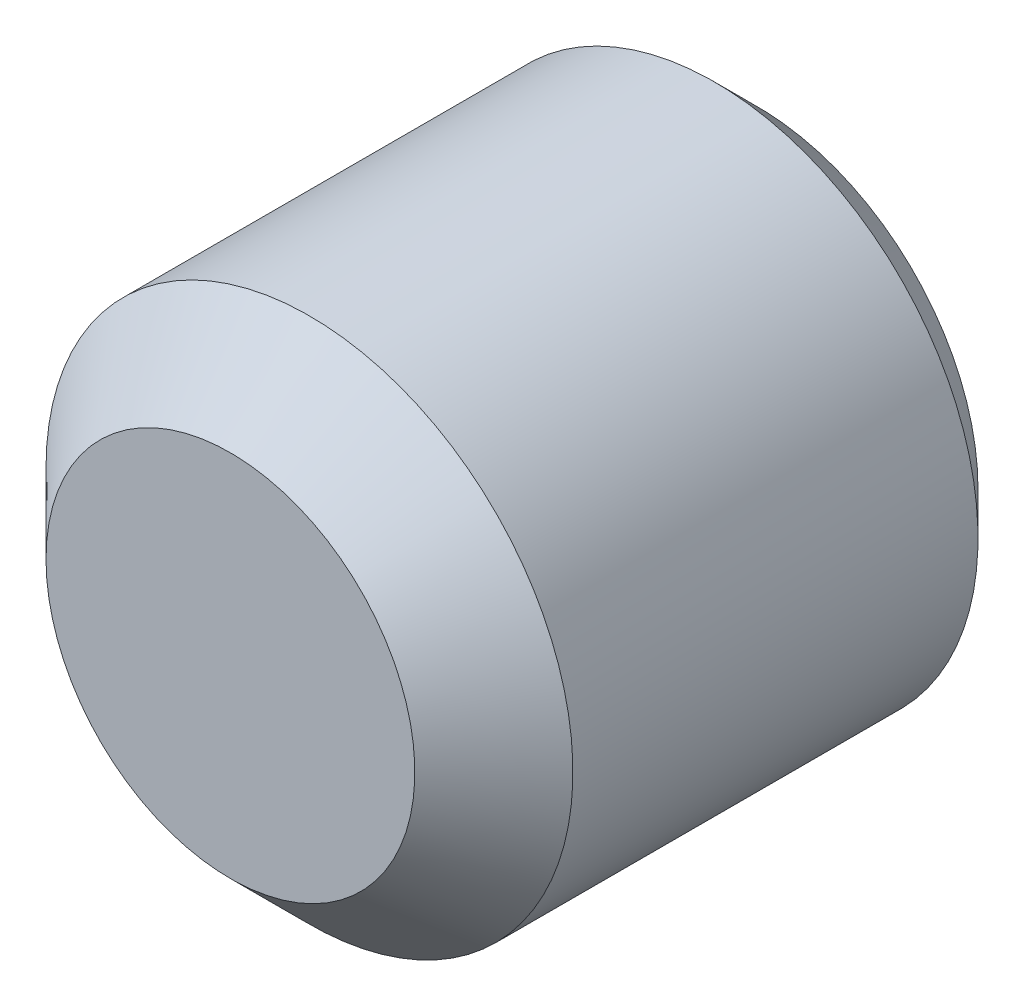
ISO-10303-21;
HEADER;
FILE_DESCRIPTION(('STEP AP214'),'2;1');
FILE_NAME('part.step','',(''),(''),'','','');
FILE_SCHEMA(('AUTOMOTIVE_DESIGN { 1 0 10303 214 1 1 1 1 }'));
ENDSEC;
DATA;
#1=APPLICATION_CONTEXT('core data for automotive mechanical design processes');
#2=APPLICATION_PROTOCOL_DEFINITION('international standard','automotive_design',2000,#1);
#3=PRODUCT_CONTEXT('',#1,'mechanical');
#4=PRODUCT('Part','Part','',(#3));
#5=PRODUCT_RELATED_PRODUCT_CATEGORY('part','',(#4));
#6=PRODUCT_DEFINITION_FORMATION('','',#4);
#7=PRODUCT_DEFINITION_CONTEXT('part definition',#1,'design');
#8=PRODUCT_DEFINITION('design','',#6,#7);
#9=PRODUCT_DEFINITION_SHAPE('','',#8);
#10=(LENGTH_UNIT() NAMED_UNIT(*) SI_UNIT(.MILLI.,.METRE.));
#11=(NAMED_UNIT(*) PLANE_ANGLE_UNIT() SI_UNIT($,.RADIAN.));
#12=(NAMED_UNIT(*) SI_UNIT($,.STERADIAN.) SOLID_ANGLE_UNIT());
#13=UNCERTAINTY_MEASURE_WITH_UNIT(LENGTH_MEASURE(1.E-05),#10,'distance_accuracy_value','');
#14=(GEOMETRIC_REPRESENTATION_CONTEXT(3) GLOBAL_UNCERTAINTY_ASSIGNED_CONTEXT((#13)) GLOBAL_UNIT_ASSIGNED_CONTEXT((#10,
#11,#12)) REPRESENTATION_CONTEXT('',''));
#15=CARTESIAN_POINT('',(0.,0.,0.));
#16=DIRECTION('',(0.,0.,1.));
#17=DIRECTION('',(1.,0.,0.));
#18=AXIS2_PLACEMENT_3D('',#15,#16,#17);
#19=CARTESIAN_POINT('',(0.,0.,0.));
#20=DIRECTION('',(0.,0.,-1.));
#21=DIRECTION('',(-1.,0.,0.));
#22=AXIS2_PLACEMENT_3D('',#19,#20,#21);
#23=PLANE('',#22);
#24=CARTESIAN_POINT('',(0.,0.,0.));
#25=DIRECTION('',(0.,0.,-1.));
#26=DIRECTION('',(-1.,0.,0.));
#27=AXIS2_PLACEMENT_3D('',#24,#25,#26);
#28=CIRCLE('',#27,4.188125);
#29=CARTESIAN_POINT('',(-4.188125,0.,0.));
#30=VERTEX_POINT('',#29);
#31=EDGE_CURVE('E11',#30,#30,#28,.T.);
#32=ORIENTED_EDGE('',*,*,#31,.T.);
#33=EDGE_LOOP('',(#32));
#34=FACE_BOUND('',#33,.T.);
#35=DIRECTION('',(-1.,0.,0.));
#36=VECTOR('',#35,1.);
#37=CARTESIAN_POINT('',(1.44337567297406,2.5,0.));
#38=LINE('',#37,#36);
#39=CARTESIAN_POINT('',(1.44337567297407,2.5,0.));
#40=VERTEX_POINT('',#39);
#41=CARTESIAN_POINT('',(-1.44337567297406,2.5,0.));
#42=VERTEX_POINT('',#41);
#43=EDGE_CURVE('E91',#40,#42,#38,.T.);
#44=ORIENTED_EDGE('',*,*,#43,.T.);
#45=DIRECTION('',(-0.5,-0.866025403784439,0.));
#46=VECTOR('',#45,1.);
#47=CARTESIAN_POINT('',(-1.44337567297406,2.5,0.));
#48=LINE('',#47,#46);
#49=CARTESIAN_POINT('',(-2.88675134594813,0.,0.));
#50=VERTEX_POINT('',#49);
#51=EDGE_CURVE('E30',#42,#50,#48,.T.);
#52=ORIENTED_EDGE('',*,*,#51,.T.);
#53=DIRECTION('',(0.5,-0.866025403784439,0.));
#54=VECTOR('',#53,1.);
#55=CARTESIAN_POINT('',(-2.88675134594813,0.,0.));
#56=LINE('',#55,#54);
#57=CARTESIAN_POINT('',(-1.44337567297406,-2.5,0.));
#58=VERTEX_POINT('',#57);
#59=EDGE_CURVE('E159',#50,#58,#56,.T.);
#60=ORIENTED_EDGE('',*,*,#59,.T.);
#61=DIRECTION('',(1.,0.,0.));
#62=VECTOR('',#61,1.);
#63=CARTESIAN_POINT('',(-1.44337567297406,-2.5,0.));
#64=LINE('',#63,#62);
#65=CARTESIAN_POINT('',(1.44337567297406,-2.5,0.));
#66=VERTEX_POINT('',#65);
#67=EDGE_CURVE('E155',#58,#66,#64,.T.);
#68=ORIENTED_EDGE('',*,*,#67,.T.);
#69=DIRECTION('',(0.5,0.866025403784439,0.));
#70=VECTOR('',#69,1.);
#71=CARTESIAN_POINT('',(1.44337567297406,-2.5,0.));
#72=LINE('',#71,#70);
#73=CARTESIAN_POINT('',(2.88675134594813,0.,0.));
#74=VERTEX_POINT('',#73);
#75=EDGE_CURVE('E150',#66,#74,#72,.T.);
#76=ORIENTED_EDGE('',*,*,#75,.T.);
#77=DIRECTION('',(-0.5,0.866025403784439,0.));
#78=VECTOR('',#77,1.);
#79=CARTESIAN_POINT('',(2.88675134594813,0.,0.));
#80=LINE('',#79,#78);
#81=EDGE_CURVE('E95',#74,#40,#80,.T.);
#82=ORIENTED_EDGE('',*,*,#81,.T.);
#83=EDGE_LOOP('',(#44,#52,#60,#68,#76,#82));
#84=FACE_BOUND('',#83,.T.);
#85=ADVANCED_FACE('F16',(#34,#84),#23,.T.);
#86=CARTESIAN_POINT('',(0.,0.,0.811875));
#87=DIRECTION('',(0.,0.,1.));
#88=DIRECTION('',(1.,0.,0.));
#89=AXIS2_PLACEMENT_3D('',#86,#87,#88);
#90=CONICAL_SURFACE('',#89,5.,0.785398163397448);
#91=ORIENTED_EDGE('',*,*,#31,.F.);
#92=EDGE_LOOP('',(#91));
#93=FACE_BOUND('',#92,.T.);
#94=CARTESIAN_POINT('',(0.,0.,0.811875));
#95=DIRECTION('',(0.,0.,-1.));
#96=DIRECTION('',(-1.,0.,0.));
#97=AXIS2_PLACEMENT_3D('',#94,#95,#96);
#98=CIRCLE('',#97,5.);
#99=CARTESIAN_POINT('',(-5.,0.,0.811874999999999));
#100=VERTEX_POINT('',#99);
#101=EDGE_CURVE('E23',#100,#100,#98,.T.);
#102=ORIENTED_EDGE('',*,*,#101,.T.);
#103=EDGE_LOOP('',(#102));
#104=FACE_BOUND('',#103,.T.);
#105=ADVANCED_FACE('F114',(#93,#104),#90,.T.);
#106=CARTESIAN_POINT('',(0.,0.,0.));
#107=DIRECTION('',(0.,0.,-1.));
#108=DIRECTION('',(-1.,0.,0.));
#109=AXIS2_PLACEMENT_3D('',#106,#107,#108);
#110=CYLINDRICAL_SURFACE('',#109,5.);
#111=ORIENTED_EDGE('',*,*,#101,.F.);
#112=EDGE_LOOP('',(#111));
#113=FACE_BOUND('',#112,.T.);
#114=CARTESIAN_POINT('',(0.,0.,8.5));
#115=DIRECTION('',(0.,0.,-1.));
#116=DIRECTION('',(-1.,0.,0.));
#117=AXIS2_PLACEMENT_3D('',#114,#115,#116);
#118=CIRCLE('',#117,5.);
#119=CARTESIAN_POINT('',(-5.,0.,8.5));
#120=VERTEX_POINT('',#119);
#121=EDGE_CURVE('E109',#120,#120,#118,.T.);
#122=ORIENTED_EDGE('',*,*,#121,.T.);
#123=EDGE_LOOP('',(#122));
#124=FACE_BOUND('',#123,.T.);
#125=ADVANCED_FACE('F116',(#113,#124),#110,.T.);
#126=CARTESIAN_POINT('',(0.,0.,10.));
#127=DIRECTION('',(0.,0.,-1.));
#128=DIRECTION('',(-1.,0.,0.));
#129=AXIS2_PLACEMENT_3D('',#126,#127,#128);
#130=CONICAL_SURFACE('',#129,3.5,0.785398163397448);
#131=ORIENTED_EDGE('',*,*,#121,.F.);
#132=EDGE_LOOP('',(#131));
#133=FACE_BOUND('',#132,.T.);
#134=CARTESIAN_POINT('',(0.,0.,10.));
#135=DIRECTION('',(0.,0.,-1.));
#136=DIRECTION('',(-1.,0.,0.));
#137=AXIS2_PLACEMENT_3D('',#134,#135,#136);
#138=CIRCLE('',#137,3.5);
#139=CARTESIAN_POINT('',(-3.5,0.,10.));
#140=VERTEX_POINT('',#139);
#141=EDGE_CURVE('E106',#140,#140,#138,.T.);
#142=ORIENTED_EDGE('',*,*,#141,.T.);
#143=EDGE_LOOP('',(#142));
#144=FACE_BOUND('',#143,.T.);
#145=ADVANCED_FACE('F119',(#133,#144),#130,.T.);
#146=CARTESIAN_POINT('',(0.,0.,10.));
#147=DIRECTION('',(0.,0.,-1.));
#148=DIRECTION('',(-1.,0.,0.));
#149=AXIS2_PLACEMENT_3D('',#146,#147,#148);
#150=PLANE('',#149);
#151=ORIENTED_EDGE('',*,*,#141,.F.);
#152=EDGE_LOOP('',(#151));
#153=FACE_BOUND('',#152,.T.);
#154=ADVANCED_FACE('F125',(#153),#150,.F.);
#155=CARTESIAN_POINT('',(-1.44337567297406,2.5,5.66666666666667));
#156=DIRECTION('',(0.866025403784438,-0.5,0.));
#157=DIRECTION('',(0.5,0.866025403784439,0.));
#158=AXIS2_PLACEMENT_3D('',#155,#156,#157);
#159=PLANE('',#158);
#160=DIRECTION('',(0.,0.,-1.));
#161=VECTOR('',#160,1.);
#162=CARTESIAN_POINT('',(-2.88675134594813,0.,5.66666666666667));
#163=LINE('',#162,#161);
#164=CARTESIAN_POINT('',(-2.88675134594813,0.,4.));
#165=VERTEX_POINT('',#164);
#166=EDGE_CURVE('E104',#165,#50,#163,.T.);
#167=ORIENTED_EDGE('',*,*,#166,.T.);
#168=ORIENTED_EDGE('',*,*,#51,.F.);
#169=DIRECTION('',(0.,0.,-1.));
#170=VECTOR('',#169,1.);
#171=CARTESIAN_POINT('',(-1.44337567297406,2.5,5.66666666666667));
#172=LINE('',#171,#170);
#173=CARTESIAN_POINT('',(-1.44337567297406,2.5,4.));
#174=VERTEX_POINT('',#173);
#175=EDGE_CURVE('E85',#174,#42,#172,.T.);
#176=ORIENTED_EDGE('',*,*,#175,.F.);
#177=CARTESIAN_POINT('',(-2.88675146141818,-2.E-07,3.99999993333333));
#178=CARTESIAN_POINT('',(-2.82332384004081,0.10985966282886,4.03663050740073));
#179=CARTESIAN_POINT('',(-2.75934871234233,0.220667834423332,4.06994409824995));
#180=CARTESIAN_POINT('',(-2.63029077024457,0.444202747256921,4.12809197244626));
#181=CARTESIAN_POINT('',(-2.56520566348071,0.556933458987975,4.15290568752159));
#182=CARTESIAN_POINT('',(-2.43584201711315,0.78099786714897,4.19153002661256));
#183=CARTESIAN_POINT('',(-2.37158337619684,0.892297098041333,4.20559774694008));
#184=CARTESIAN_POINT('',(-2.242763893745,1.11541898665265,4.22238853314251));
#185=CARTESIAN_POINT('',(-2.17820352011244,1.22724083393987,4.22512550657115));
#186=CARTESIAN_POINT('',(-2.05757937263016,1.43616798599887,4.21941714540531));
#187=CARTESIAN_POINT('',(-2.00149749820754,1.53330464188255,4.21237340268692));
#188=CARTESIAN_POINT('',(-1.8896991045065,1.72694513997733,4.19005338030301));
#189=CARTESIAN_POINT('',(-1.8339829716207,1.8234483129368,4.17476948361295));
#190=CARTESIAN_POINT('',(-1.721954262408,2.01748772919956,4.136562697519));
#191=CARTESIAN_POINT('',(-1.66565585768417,2.1149994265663,4.11347792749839));
#192=CARTESIAN_POINT('',(-1.5538984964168,2.30856885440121,4.06108525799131));
#193=CARTESIAN_POINT('',(-1.49843810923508,2.40462906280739,4.03178966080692));
#194=CARTESIAN_POINT('',(-1.44337555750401,2.5000002,3.99999993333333));
#195=B_SPLINE_CURVE_WITH_KNOTS('',3,(#177,#178,#179,#180,#181,#182,#183,#184,#185,#186,#187,
#188,#189,#190,#191,#192,#193,#194),.UNSPECIFIED.,.F.,.F.,(4,2,2,2,2,2,2,2,4),(0.,
0.396270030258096,0.793492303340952,1.18088455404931,1.56780117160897,1.90463489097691,
2.24178050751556,2.58640240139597,2.9303479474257),.UNSPECIFIED.);
#196=EDGE_CURVE('E78',#165,#174,#195,.T.);
#197=ORIENTED_EDGE('',*,*,#196,.F.);
#198=EDGE_LOOP('',(#167,#168,#176,#197));
#199=FACE_BOUND('',#198,.T.);
#200=ADVANCED_FACE('F86',(#199),#159,.T.);
#201=CARTESIAN_POINT('',(-2.88675134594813,0.,5.66666666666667));
#202=DIRECTION('',(0.866025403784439,0.5,0.));
#203=DIRECTION('',(-0.5,0.866025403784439,0.));
#204=AXIS2_PLACEMENT_3D('',#201,#202,#203);
#205=PLANE('',#204);
#206=DIRECTION('',(0.,0.,-1.));
#207=VECTOR('',#206,1.);
#208=CARTESIAN_POINT('',(-1.44337567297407,-2.5,5.66666666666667));
#209=LINE('',#208,#207);
#210=CARTESIAN_POINT('',(-1.44337567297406,-2.5,4.));
#211=VERTEX_POINT('',#210);
#212=EDGE_CURVE('E102',#211,#58,#209,.T.);
#213=ORIENTED_EDGE('',*,*,#212,.T.);
#214=ORIENTED_EDGE('',*,*,#59,.F.);
#215=ORIENTED_EDGE('',*,*,#166,.F.);
#216=CARTESIAN_POINT('',(-1.44337555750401,-2.5000002,3.99999993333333));
#217=CARTESIAN_POINT('',(-1.50680317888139,-2.39014033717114,4.03663050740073));
#218=CARTESIAN_POINT('',(-1.57077830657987,-2.27933216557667,4.06994409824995));
#219=CARTESIAN_POINT('',(-1.69983624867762,-2.05579725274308,4.12809197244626));
#220=CARTESIAN_POINT('',(-1.76492135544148,-1.94306654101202,4.15290568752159));
#221=CARTESIAN_POINT('',(-1.89428500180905,-1.71900213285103,4.19153002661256));
#222=CARTESIAN_POINT('',(-1.95854364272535,-1.60770290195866,4.20559774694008));
#223=CARTESIAN_POINT('',(-2.0873631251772,-1.38458101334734,4.22238853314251));
#224=CARTESIAN_POINT('',(-2.15192349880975,-1.27275916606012,4.22512550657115));
#225=CARTESIAN_POINT('',(-2.27254764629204,-1.06383201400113,4.21941714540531));
#226=CARTESIAN_POINT('',(-2.32862952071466,-0.966695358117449,4.21237340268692));
#227=CARTESIAN_POINT('',(-2.44042791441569,-0.773054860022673,4.190053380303));
#228=CARTESIAN_POINT('',(-2.4961440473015,-0.676551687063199,4.17476948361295));
#229=CARTESIAN_POINT('',(-2.6081727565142,-0.482512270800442,4.136562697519));
#230=CARTESIAN_POINT('',(-2.66447116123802,-0.385000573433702,4.11347792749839));
#231=CARTESIAN_POINT('',(-2.77622852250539,-0.191431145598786,4.06108525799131));
#232=CARTESIAN_POINT('',(-2.83168890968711,-0.0953709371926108,4.03178966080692));
#233=CARTESIAN_POINT('',(-2.88675146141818,1.99999999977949E-07,3.99999993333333));
#234=B_SPLINE_CURVE_WITH_KNOTS('',3,(#216,#217,#218,#219,#220,#221,#222,#223,#224,#225,#226,
#227,#228,#229,#230,#231,#232,#233),.UNSPECIFIED.,.F.,.F.,(4,2,2,2,2,2,2,2,4),(0.,
0.396270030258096,0.793492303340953,1.18088455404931,1.56780117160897,1.90463489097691,
2.24178050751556,2.58640240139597,2.9303479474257),.UNSPECIFIED.);
#235=EDGE_CURVE('E82',#211,#165,#234,.T.);
#236=ORIENTED_EDGE('',*,*,#235,.F.);
#237=EDGE_LOOP('',(#213,#214,#215,#236));
#238=FACE_BOUND('',#237,.T.);
#239=ADVANCED_FACE('F135',(#238),#205,.T.);
#240=CARTESIAN_POINT('',(-1.44337567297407,-2.5,5.66666666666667));
#241=DIRECTION('',(0.,1.,0.));
#242=DIRECTION('',(-1.,0.,0.));
#243=AXIS2_PLACEMENT_3D('',#240,#241,#242);
#244=PLANE('',#243);
#245=DIRECTION('',(0.,0.,-1.));
#246=VECTOR('',#245,1.);
#247=CARTESIAN_POINT('',(1.44337567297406,-2.5,5.66666666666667));
#248=LINE('',#247,#246);
#249=CARTESIAN_POINT('',(1.44337567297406,-2.5,4.));
#250=VERTEX_POINT('',#249);
#251=EDGE_CURVE('E100',#250,#66,#248,.T.);
#252=ORIENTED_EDGE('',*,*,#251,.T.);
#253=ORIENTED_EDGE('',*,*,#67,.F.);
#254=ORIENTED_EDGE('',*,*,#212,.F.);
#255=CARTESIAN_POINT('',(3.73786280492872,-2.5,3.07041177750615));
#256=CARTESIAN_POINT('',(3.62990419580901,-2.5,3.12220623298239));
#257=CARTESIAN_POINT('',(3.52168258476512,-2.5,3.17346270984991));
#258=CARTESIAN_POINT('',(3.30457318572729,-2.5,3.27459452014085));
#259=CARTESIAN_POINT('',(3.19568528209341,-2.5,3.32446960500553));
#260=CARTESIAN_POINT('',(2.97647879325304,-2.5,3.42281207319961));
#261=CARTESIAN_POINT('',(2.8661555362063,-2.5,3.47126908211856));
#262=CARTESIAN_POINT('',(2.64458326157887,-2.5,3.56601016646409));
#263=CARTESIAN_POINT('',(2.53333429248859,-2.5,3.61229435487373));
#264=CARTESIAN_POINT('',(2.30680313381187,-2.5,3.70328978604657));
#265=CARTESIAN_POINT('',(2.19149154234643,-2.5,3.74792826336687));
#266=CARTESIAN_POINT('',(1.95947357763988,-2.5,3.8334939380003));
#267=CARTESIAN_POINT('',(1.84276704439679,-2.5,3.87442070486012));
#268=CARTESIAN_POINT('',(1.60804308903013,-2.5,3.9513925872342));
#269=CARTESIAN_POINT('',(1.49002940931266,-2.5,3.98744899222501));
#270=CARTESIAN_POINT('',(1.25231072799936,-2.5,4.05344707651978));
#271=CARTESIAN_POINT('',(1.13260615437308,-2.5,4.08339027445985));
#272=CARTESIAN_POINT('',(0.891755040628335,-2.5,4.13556574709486));
#273=CARTESIAN_POINT('',(0.77061199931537,-2.5,4.15781385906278));
#274=CARTESIAN_POINT('',(0.526970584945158,-2.5,4.19314231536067));
#275=CARTESIAN_POINT('',(0.404472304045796,-2.5,4.20622327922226));
#276=CARTESIAN_POINT('',(0.160266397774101,-2.5,4.22200378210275));
#277=CARTESIAN_POINT('',(0.0385668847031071,-2.5,4.22482582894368));
#278=CARTESIAN_POINT('',(-0.204641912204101,-2.5,4.2201642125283));
#279=CARTESIAN_POINT('',(-0.326151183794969,-2.5,4.2126799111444));
#280=CARTESIAN_POINT('',(-0.536550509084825,-2.5,4.19130137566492));
#281=CARTESIAN_POINT('',(-0.625673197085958,-2.5,4.17959119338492));
#282=CARTESIAN_POINT('',(-0.803173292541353,-2.5,4.15143179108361));
#283=CARTESIAN_POINT('',(-0.891550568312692,-2.5,4.13498175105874));
#284=CARTESIAN_POINT('',(-1.15551872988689,-2.5,4.07939186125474));
#285=CARTESIAN_POINT('',(-1.32980846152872,-2.5,4.03402793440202));
#286=CARTESIAN_POINT('',(-1.59042393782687,-2.5,3.95652588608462));
#287=CARTESIAN_POINT('',(-1.67812348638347,-2.5,3.92875431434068));
#288=CARTESIAN_POINT('',(-1.8526147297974,-2.5,3.87064295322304));
#289=CARTESIAN_POINT('',(-1.93940695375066,-2.5,3.84030476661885));
#290=CARTESIAN_POINT('',(-2.11219306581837,-2.5,3.7774997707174));
#291=CARTESIAN_POINT('',(-2.19818709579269,-2.5,3.74503334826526));
#292=CARTESIAN_POINT('',(-2.36949800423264,-2.5,3.67832354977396));
#293=CARTESIAN_POINT('',(-2.4548147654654,-2.5,3.6440798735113));
#294=CARTESIAN_POINT('',(-2.67258788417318,-2.5,3.55447732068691));
#295=CARTESIAN_POINT('',(-2.80460848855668,-2.5,3.49806074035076));
#296=CARTESIAN_POINT('',(-3.06746028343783,-2.5,3.38251346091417));
#297=CARTESIAN_POINT('',(-3.19829138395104,-2.5,3.32338255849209));
#298=CARTESIAN_POINT('',(-3.45901011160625,-2.5,3.20302302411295));
#299=CARTESIAN_POINT('',(-3.58889757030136,-2.5,3.14179402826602));
#300=CARTESIAN_POINT('',(-3.84789024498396,-2.5,3.01770085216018));
#301=CARTESIAN_POINT('',(-3.97699544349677,-2.5,2.95483663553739));
#302=CARTESIAN_POINT('',(-4.36366993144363,-2.5,2.7641677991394));
#303=CARTESIAN_POINT('',(-4.62028653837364,-2.5,2.63443298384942));
#304=CARTESIAN_POINT('',(-5.13176271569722,-2.5,2.37164542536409));
#305=CARTESIAN_POINT('',(-5.38662250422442,-2.5,2.23859310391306));
#306=CARTESIAN_POINT('',(-5.87112719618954,-2.5,1.98285278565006));
#307=CARTESIAN_POINT('',(-6.10088157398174,-2.5,1.86037185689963));
#308=CARTESIAN_POINT('',(-6.55965134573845,-2.5,1.61401553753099));
#309=CARTESIAN_POINT('',(-6.78866671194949,-2.5,1.49014009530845));
#310=CARTESIAN_POINT('',(-7.24554624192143,-2.5,1.24165978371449));
#311=CARTESIAN_POINT('',(-7.47341185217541,-2.5,1.11705757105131));
#312=CARTESIAN_POINT('',(-7.92868238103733,-2.5,0.867042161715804));
#313=CARTESIAN_POINT('',(-8.15608732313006,-2.5,0.741629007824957));
#314=CARTESIAN_POINT('',(-8.38332676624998,-2.5,0.615918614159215));
#315=B_SPLINE_CURVE_WITH_KNOTS('',3,(#255,#256,#257,#258,#259,#260,#261,#262,#263,#264,#265,
#266,#267,#268,#269,#270,#271,#272,#273,#274,#275,#276,#277,#278,#279,#280,#281,#282,#283,#284,
#285,#286,#287,#288,#289,#290,#291,#292,#293,#294,#295,#296,#297,#298,#299,#300,#301,#302,#303,
#304,#305,#306,#307,#308,#309,#310,#311,#312,#313,#314),.UNSPECIFIED.,.F.,.F.,(4,2,2,2,2,2,2,2,
2,2,2,2,2,2,2,2,2,2,2,2,2,2,2,2,2,2,2,2,2,4),(0.,0.359225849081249,0.718515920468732,
1.07998545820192,1.44143617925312,1.81233727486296,2.1832813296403,2.55335021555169,
2.92332705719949,3.29253785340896,3.66172369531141,4.02648611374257,4.39127111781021,
4.66080405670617,4.9303836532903,5.46995615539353,5.74591175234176,6.02169627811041,
6.29743081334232,6.57321207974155,7.00387724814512,7.43457472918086,7.86534729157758,
8.29612944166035,9.1587257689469,10.021212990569,10.8022940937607,11.5834041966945,
12.3625275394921,13.1416101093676),.UNSPECIFIED.);
#316=EDGE_CURVE('E200',#250,#211,#315,.T.);
#317=ORIENTED_EDGE('',*,*,#316,.F.);
#318=EDGE_LOOP('',(#252,#253,#254,#317));
#319=FACE_BOUND('',#318,.T.);
#320=ADVANCED_FACE('F206',(#319),#244,.T.);
#321=CARTESIAN_POINT('',(1.44337567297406,-2.5,5.66666666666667));
#322=DIRECTION('',(-0.866025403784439,0.5,0.));
#323=DIRECTION('',(-0.5,-0.866025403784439,0.));
#324=AXIS2_PLACEMENT_3D('',#321,#322,#323);
#325=PLANE('',#324);
#326=DIRECTION('',(0.,0.,-1.));
#327=VECTOR('',#326,1.);
#328=CARTESIAN_POINT('',(2.88675134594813,0.,5.66666666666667));
#329=LINE('',#328,#327);
#330=CARTESIAN_POINT('',(2.88675134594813,0.,4.));
#331=VERTEX_POINT('',#330);
#332=EDGE_CURVE('E93',#331,#74,#329,.T.);
#333=ORIENTED_EDGE('',*,*,#332,.T.);
#334=ORIENTED_EDGE('',*,*,#75,.F.);
#335=ORIENTED_EDGE('',*,*,#251,.F.);
#336=CARTESIAN_POINT('',(2.88675146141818,1.99999999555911E-07,3.99999993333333));
#337=CARTESIAN_POINT('',(2.8233238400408,-0.109859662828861,4.03663050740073));
#338=CARTESIAN_POINT('',(2.75934871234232,-0.220667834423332,4.06994409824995));
#339=CARTESIAN_POINT('',(2.63029077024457,-0.444202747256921,4.12809197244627));
#340=CARTESIAN_POINT('',(2.56520566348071,-0.556933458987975,4.15290568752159));
#341=CARTESIAN_POINT('',(2.43584201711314,-0.78099786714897,4.19153002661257));
#342=CARTESIAN_POINT('',(2.37158337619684,-0.892297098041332,4.20559774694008));
#343=CARTESIAN_POINT('',(2.242763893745,-1.11541898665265,4.22238853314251));
#344=CARTESIAN_POINT('',(2.17820352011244,-1.22724083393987,4.22512550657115));
#345=CARTESIAN_POINT('',(2.05757937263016,-1.43616798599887,4.21941714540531));
#346=CARTESIAN_POINT('',(2.00149749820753,-1.53330464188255,4.21237340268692));
#347=CARTESIAN_POINT('',(1.8896991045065,-1.72694513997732,4.19005338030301));
#348=CARTESIAN_POINT('',(1.8339829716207,-1.8234483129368,4.17476948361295));
#349=CARTESIAN_POINT('',(1.721954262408,-2.01748772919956,4.136562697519));
#350=CARTESIAN_POINT('',(1.66565585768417,-2.1149994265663,4.1134779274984));
#351=CARTESIAN_POINT('',(1.5538984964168,-2.30856885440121,4.06108525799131));
#352=CARTESIAN_POINT('',(1.49843810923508,-2.40462906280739,4.03178966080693));
#353=CARTESIAN_POINT('',(1.44337555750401,-2.5000002,3.99999993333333));
#354=B_SPLINE_CURVE_WITH_KNOTS('',3,(#336,#337,#338,#339,#340,#341,#342,#343,#344,#345,#346,
#347,#348,#349,#350,#351,#352,#353),.UNSPECIFIED.,.F.,.F.,(4,2,2,2,2,2,2,2,4),(0.,
0.396270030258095,0.793492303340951,1.18088455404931,1.56780117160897,1.90463489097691,
2.24178050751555,2.58640240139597,2.9303479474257),.UNSPECIFIED.);
#355=EDGE_CURVE('E194',#331,#250,#354,.T.);
#356=ORIENTED_EDGE('',*,*,#355,.F.);
#357=EDGE_LOOP('',(#333,#334,#335,#356));
#358=FACE_BOUND('',#357,.T.);
#359=ADVANCED_FACE('F209',(#358),#325,.T.);
#360=CARTESIAN_POINT('',(2.88675134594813,0.,5.66666666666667));
#361=DIRECTION('',(-0.866025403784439,-0.5,0.));
#362=DIRECTION('',(0.5,-0.866025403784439,0.));
#363=AXIS2_PLACEMENT_3D('',#360,#361,#362);
#364=PLANE('',#363);
#365=DIRECTION('',(0.,0.,-1.));
#366=VECTOR('',#365,1.);
#367=CARTESIAN_POINT('',(1.44337567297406,2.5,5.66666666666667));
#368=LINE('',#367,#366);
#369=CARTESIAN_POINT('',(1.44337567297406,2.5,4.));
#370=VERTEX_POINT('',#369);
#371=EDGE_CURVE('E90',#370,#40,#368,.T.);
#372=ORIENTED_EDGE('',*,*,#371,.T.);
#373=ORIENTED_EDGE('',*,*,#81,.F.);
#374=ORIENTED_EDGE('',*,*,#332,.F.);
#375=CARTESIAN_POINT('',(1.44337555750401,2.5000002,3.99999993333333));
#376=CARTESIAN_POINT('',(1.50680317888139,2.39014033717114,4.03663050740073));
#377=CARTESIAN_POINT('',(1.57077830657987,2.27933216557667,4.06994409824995));
#378=CARTESIAN_POINT('',(1.69983624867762,2.05579725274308,4.12809197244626));
#379=CARTESIAN_POINT('',(1.76492135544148,1.94306654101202,4.15290568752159));
#380=CARTESIAN_POINT('',(1.89428500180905,1.71900213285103,4.19153002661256));
#381=CARTESIAN_POINT('',(1.95854364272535,1.60770290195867,4.20559774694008));
#382=CARTESIAN_POINT('',(2.0873631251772,1.38458101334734,4.22238853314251));
#383=CARTESIAN_POINT('',(2.15192349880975,1.27275916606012,4.22512550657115));
#384=CARTESIAN_POINT('',(2.27254764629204,1.06383201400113,4.21941714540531));
#385=CARTESIAN_POINT('',(2.32862952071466,0.966695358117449,4.21237340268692));
#386=CARTESIAN_POINT('',(2.44042791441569,0.773054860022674,4.190053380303));
#387=CARTESIAN_POINT('',(2.4961440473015,0.6765516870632,4.17476948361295));
#388=CARTESIAN_POINT('',(2.6081727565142,0.482512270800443,4.136562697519));
#389=CARTESIAN_POINT('',(2.66447116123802,0.385000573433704,4.11347792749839));
#390=CARTESIAN_POINT('',(2.77622852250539,0.191431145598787,4.06108525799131));
#391=CARTESIAN_POINT('',(2.83168890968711,0.095370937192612,4.03178966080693));
#392=CARTESIAN_POINT('',(2.88675146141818,-2.00000000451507E-07,3.99999993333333));
#393=B_SPLINE_CURVE_WITH_KNOTS('',3,(#375,#376,#377,#378,#379,#380,#381,#382,#383,#384,#385,
#386,#387,#388,#389,#390,#391,#392),.UNSPECIFIED.,.F.,.F.,(4,2,2,2,2,2,2,2,4),(0.,
0.396270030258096,0.793492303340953,1.18088455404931,1.56780117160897,1.90463489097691,
2.24178050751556,2.58640240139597,2.93034794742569),.UNSPECIFIED.);
#394=EDGE_CURVE('E38',#370,#331,#393,.T.);
#395=ORIENTED_EDGE('',*,*,#394,.F.);
#396=EDGE_LOOP('',(#372,#373,#374,#395));
#397=FACE_BOUND('',#396,.T.);
#398=ADVANCED_FACE('F149',(#397),#364,.T.);
#399=CARTESIAN_POINT('',(1.44337567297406,2.5,5.66666666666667));
#400=DIRECTION('',(0.,-1.,0.));
#401=DIRECTION('',(1.,0.,0.));
#402=AXIS2_PLACEMENT_3D('',#399,#400,#401);
#403=PLANE('',#402);
#404=ORIENTED_EDGE('',*,*,#175,.T.);
#405=ORIENTED_EDGE('',*,*,#43,.F.);
#406=ORIENTED_EDGE('',*,*,#371,.F.);
#407=CARTESIAN_POINT('',(3.73786280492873,2.5,3.07041177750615));
#408=CARTESIAN_POINT('',(3.62990419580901,2.5,3.12220623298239));
#409=CARTESIAN_POINT('',(3.52168258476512,2.5,3.17346270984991));
#410=CARTESIAN_POINT('',(3.30457318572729,2.5,3.27459452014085));
#411=CARTESIAN_POINT('',(3.19568528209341,2.5,3.32446960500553));
#412=CARTESIAN_POINT('',(2.97647879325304,2.5,3.42281207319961));
#413=CARTESIAN_POINT('',(2.86615553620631,2.5,3.47126908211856));
#414=CARTESIAN_POINT('',(2.64458326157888,2.5,3.56601016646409));
#415=CARTESIAN_POINT('',(2.5333342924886,2.5,3.61229435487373));
#416=CARTESIAN_POINT('',(2.30680313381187,2.5,3.70328978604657));
#417=CARTESIAN_POINT('',(2.19149154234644,2.5,3.74792826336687));
#418=CARTESIAN_POINT('',(1.95947357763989,2.5,3.8334939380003));
#419=CARTESIAN_POINT('',(1.84276704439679,2.5,3.87442070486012));
#420=CARTESIAN_POINT('',(1.60804308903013,2.5,3.9513925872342));
#421=CARTESIAN_POINT('',(1.49002940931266,2.5,3.98744899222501));
#422=CARTESIAN_POINT('',(1.25231072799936,2.5,4.05344707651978));
#423=CARTESIAN_POINT('',(1.13260615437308,2.5,4.08339027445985));
#424=CARTESIAN_POINT('',(0.891755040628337,2.5,4.13556574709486));
#425=CARTESIAN_POINT('',(0.770611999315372,2.5,4.15781385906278));
#426=CARTESIAN_POINT('',(0.526970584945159,2.5,4.19314231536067));
#427=CARTESIAN_POINT('',(0.404472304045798,2.5,4.20622327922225));
#428=CARTESIAN_POINT('',(0.160266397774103,2.5,4.22200378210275));
#429=CARTESIAN_POINT('',(0.0385668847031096,2.5,4.22482582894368));
#430=CARTESIAN_POINT('',(-0.204641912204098,2.5,4.2201642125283));
#431=CARTESIAN_POINT('',(-0.326151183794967,2.5,4.2126799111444));
#432=CARTESIAN_POINT('',(-0.536550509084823,2.5,4.19130137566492));
#433=CARTESIAN_POINT('',(-0.625673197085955,2.5,4.17959119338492));
#434=CARTESIAN_POINT('',(-0.80317329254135,2.5,4.15143179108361));
#435=CARTESIAN_POINT('',(-0.891550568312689,2.5,4.13498175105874));
#436=CARTESIAN_POINT('',(-1.15551872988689,2.5,4.07939186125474));
#437=CARTESIAN_POINT('',(-1.32980846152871,2.5,4.03402793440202));
#438=CARTESIAN_POINT('',(-1.59042393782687,2.5,3.95652588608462));
#439=CARTESIAN_POINT('',(-1.67812348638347,2.5,3.92875431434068));
#440=CARTESIAN_POINT('',(-1.85261472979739,2.5,3.87064295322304));
#441=CARTESIAN_POINT('',(-1.93940695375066,2.5,3.84030476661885));
#442=CARTESIAN_POINT('',(-2.11219306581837,2.5,3.7774997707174));
#443=CARTESIAN_POINT('',(-2.19818709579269,2.5,3.74503334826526));
#444=CARTESIAN_POINT('',(-2.36949800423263,2.5,3.67832354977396));
#445=CARTESIAN_POINT('',(-2.4548147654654,2.5,3.6440798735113));
#446=CARTESIAN_POINT('',(-2.67258788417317,2.5,3.55447732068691));
#447=CARTESIAN_POINT('',(-2.80460848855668,2.5,3.49806074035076));
#448=CARTESIAN_POINT('',(-3.06746028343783,2.5,3.38251346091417));
#449=CARTESIAN_POINT('',(-3.19829138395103,2.5,3.32338255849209));
#450=CARTESIAN_POINT('',(-3.45901011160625,2.5,3.20302302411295));
#451=CARTESIAN_POINT('',(-3.58889757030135,2.5,3.14179402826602));
#452=CARTESIAN_POINT('',(-3.84789024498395,2.5,3.01770085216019));
#453=CARTESIAN_POINT('',(-3.97699544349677,2.5,2.95483663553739));
#454=CARTESIAN_POINT('',(-4.36366993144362,2.5,2.7641677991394));
#455=CARTESIAN_POINT('',(-4.62028653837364,2.5,2.63443298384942));
#456=CARTESIAN_POINT('',(-5.13176271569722,2.5,2.37164542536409));
#457=CARTESIAN_POINT('',(-5.38662250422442,2.5,2.23859310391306));
#458=CARTESIAN_POINT('',(-5.87112719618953,2.5,1.98285278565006));
#459=CARTESIAN_POINT('',(-6.10088157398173,2.5,1.86037185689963));
#460=CARTESIAN_POINT('',(-6.55965134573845,2.5,1.61401553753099));
#461=CARTESIAN_POINT('',(-6.78866671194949,2.5,1.49014009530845));
#462=CARTESIAN_POINT('',(-7.24554624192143,2.50000000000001,1.24165978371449));
#463=CARTESIAN_POINT('',(-7.47341185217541,2.50000000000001,1.11705757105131));
#464=CARTESIAN_POINT('',(-7.92868238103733,2.50000000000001,0.867042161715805));
#465=CARTESIAN_POINT('',(-8.15608732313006,2.5,0.741629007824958));
#466=CARTESIAN_POINT('',(-8.38332676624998,2.5,0.615918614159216));
#467=B_SPLINE_CURVE_WITH_KNOTS('',3,(#407,#408,#409,#410,#411,#412,#413,#414,#415,#416,#417,
#418,#419,#420,#421,#422,#423,#424,#425,#426,#427,#428,#429,#430,#431,#432,#433,#434,#435,#436,
#437,#438,#439,#440,#441,#442,#443,#444,#445,#446,#447,#448,#449,#450,#451,#452,#453,#454,#455,
#456,#457,#458,#459,#460,#461,#462,#463,#464,#465,#466),.UNSPECIFIED.,.F.,.F.,(4,2,2,2,2,2,2,2,
2,2,2,2,2,2,2,2,2,2,2,2,2,2,2,2,2,2,2,2,2,4),(0.,0.35922584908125,0.718515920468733,
1.07998545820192,1.44143617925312,1.81233727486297,2.1832813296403,2.55335021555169,
2.92332705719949,3.29253785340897,3.66172369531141,4.02648611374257,4.39127111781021,
4.66080405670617,4.9303836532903,5.46995615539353,5.74591175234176,6.02169627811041,
6.29743081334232,6.57321207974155,7.00387724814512,7.43457472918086,7.86534729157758,
8.29612944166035,9.1587257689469,10.021212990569,10.8022940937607,11.5834041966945,
12.3625275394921,13.1416101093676),.UNSPECIFIED.);
#468=EDGE_CURVE('E79',#174,#370,#467,.F.);
#469=ORIENTED_EDGE('',*,*,#468,.F.);
#470=EDGE_LOOP('',(#404,#405,#406,#469));
#471=FACE_BOUND('',#470,.T.);
#472=ADVANCED_FACE('F74',(#471),#403,.T.);
#473=CARTESIAN_POINT('',(0.,0.,5.66666666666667));
#474=DIRECTION('',(0.,0.,-1.));
#475=DIRECTION('',(-1.,0.,0.));
#476=AXIS2_PLACEMENT_3D('',#473,#474,#475);
#477=CONICAL_SURFACE('',#476,0.,1.0471975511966);
#478=CARTESIAN_POINT('',(0.,0.,5.66666666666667));
#479=VERTEX_POINT('',#478);
#480=VERTEX_LOOP('',#479);
#481=FACE_BOUND('',#480,.T.);
#482=ORIENTED_EDGE('',*,*,#196,.T.);
#483=ORIENTED_EDGE('',*,*,#468,.T.);
#484=ORIENTED_EDGE('',*,*,#394,.T.);
#485=ORIENTED_EDGE('',*,*,#355,.T.);
#486=ORIENTED_EDGE('',*,*,#316,.T.);
#487=ORIENTED_EDGE('',*,*,#235,.T.);
#488=EDGE_LOOP('',(#482,#483,#484,#485,#486,#487));
#489=FACE_BOUND('',#488,.T.);
#490=ADVANCED_FACE('F71',(#481,#489),#477,.F.);
#491=CLOSED_SHELL('',(#85,#105,#125,#145,#154,#200,#239,#320,#359,#398,#472,#490));
#492=MANIFOLD_SOLID_BREP('B1',#491);
#493=ADVANCED_BREP_SHAPE_REPRESENTATION('',(#18,#492),#14);
#494=SHAPE_DEFINITION_REPRESENTATION(#9,#493);
ENDSEC;
END-ISO-10303-21;
